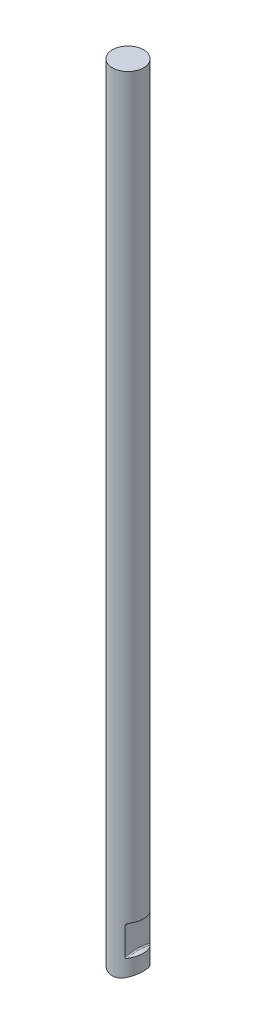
from build123d import *

# Parameters (mm, degrees)
SKETCH1_W               = 10
SKETCH1_H               = 260
BOSS_EXTRUDE1_DEPTH     = 5
CUT_EXTRUDE4_DEPTH      = 261.096136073
CUT_EXTRUDE4_DEPTH_BACK = 261.096136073
SKETCH8_R               = 10
SKETCH2_W               = 2
SKETCH2_H               = 9.5
FILLET1_R               = 0.762
FILLET2_R               = 0.381
SKETCH9_OUTSIDE_W       = 62.348
SKETCH9_OUTSIDE_H       = 62.348
SKETCH9_OUTSIDE_R       = 5
CUT_EXTRUDE5_DEPTH      = 252.43919335


with BuildPart() as part:
    # Sketch1 → Boss-Extrude1 (new, symmetric)
    with BuildSketch(Plane(origin=(0, 0, 0), x_dir=(0, 0, -1), z_dir=(1, 0, 0))):
        with Locations((0, 130)):
            Rectangle(SKETCH1_W, SKETCH1_H)
    extrude(amount=BOSS_EXTRUDE1_DEPTH, both=True)

    # Sketch8 → Cut-Extrude4 (cut, two sides: drawn at the far end of the back side and taken through both)
    with BuildSketch(Plane(origin=(0, 0, 0), x_dir=(0, 0, -1), z_dir=(1, 0, 0)).offset(-CUT_EXTRUDE4_DEPTH_BACK)):
        Circle(SKETCH8_R)
    extrude(amount=CUT_EXTRUDE4_DEPTH + CUT_EXTRUDE4_DEPTH_BACK, mode=Mode.SUBTRACT)

    # Sketch2 → Cut-Revolve1 (revolve, cut)
    with BuildSketch(Plane.XY):
        with Locations((4, 19.75)):
            Rectangle(SKETCH2_W, SKETCH2_H)
        with Locations((-4, 19.75)):
            Rectangle(SKETCH2_W, SKETCH2_H)
    revolve(axis=Axis((-8.84822894, 0, 0), (1, 0, 0)), mode=Mode.SUBTRACT)

    # Fillet1
    fillet1_edges = [part.edges().sort_by_distance(p)[0] for p in [
        (3, 24.5, 0),
        (-3, 24.5, 0),
    ]]
    fillet(fillet1_edges, radius=FILLET1_R)

    # Fillet2
    fillet2_edges = [part.edges().sort_by_distance(p)[0] for p in [
        (3, 15, 0),
        (-3, 15, 0),
    ]]
    fillet(fillet2_edges, radius=FILLET2_R)

    # Sketch9 outside → Cut-Extrude5 (cut, through all)
    with BuildSketch(Plane(origin=(0, 260, 0), x_dir=(1, 0, 0), z_dir=(0, 1, 0))):
        Rectangle(SKETCH9_OUTSIDE_W, SKETCH9_OUTSIDE_H)
        with Locations(Location((0, 0, 0), (0, 0, 270))):
            Circle(SKETCH9_OUTSIDE_R, mode=Mode.SUBTRACT)
    extrude(amount=-CUT_EXTRUDE5_DEPTH, mode=Mode.SUBTRACT)


solid = part.part
